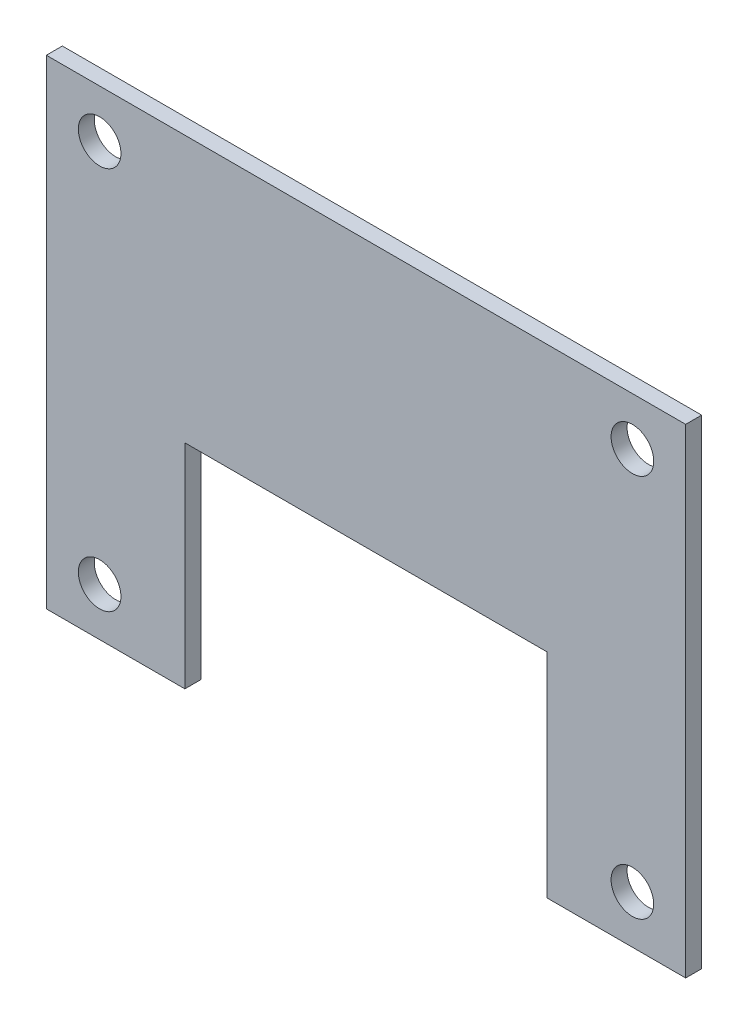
ISO-10303-21;
HEADER;
FILE_DESCRIPTION(('STEP AP214'),'2;1');
FILE_NAME('part.step','',(''),(''),'','','');
FILE_SCHEMA(('AUTOMOTIVE_DESIGN { 1 0 10303 214 1 1 1 1 }'));
ENDSEC;
DATA;
#1=APPLICATION_CONTEXT('core data for automotive mechanical design processes');
#2=APPLICATION_PROTOCOL_DEFINITION('international standard','automotive_design',2000,#1);
#3=PRODUCT_CONTEXT('',#1,'mechanical');
#4=PRODUCT('Part','Part','',(#3));
#5=PRODUCT_RELATED_PRODUCT_CATEGORY('part','',(#4));
#6=PRODUCT_DEFINITION_FORMATION('','',#4);
#7=PRODUCT_DEFINITION_CONTEXT('part definition',#1,'design');
#8=PRODUCT_DEFINITION('design','',#6,#7);
#9=PRODUCT_DEFINITION_SHAPE('','',#8);
#10=(LENGTH_UNIT() NAMED_UNIT(*) SI_UNIT(.MILLI.,.METRE.));
#11=(NAMED_UNIT(*) PLANE_ANGLE_UNIT() SI_UNIT($,.RADIAN.));
#12=(NAMED_UNIT(*) SI_UNIT($,.STERADIAN.) SOLID_ANGLE_UNIT());
#13=UNCERTAINTY_MEASURE_WITH_UNIT(LENGTH_MEASURE(1.E-05),#10,'distance_accuracy_value','');
#14=(GEOMETRIC_REPRESENTATION_CONTEXT(3) GLOBAL_UNCERTAINTY_ASSIGNED_CONTEXT((#13)) GLOBAL_UNIT_ASSIGNED_CONTEXT((#10,
#11,#12)) REPRESENTATION_CONTEXT('',''));
#15=CARTESIAN_POINT('',(0.,0.,0.));
#16=DIRECTION('',(0.,0.,1.));
#17=DIRECTION('',(1.,0.,0.));
#18=AXIS2_PLACEMENT_3D('',#15,#16,#17);
#19=CARTESIAN_POINT('',(0.,0.,1.5));
#20=DIRECTION('',(0.,0.,-1.));
#21=DIRECTION('',(-1.,0.,0.));
#22=AXIS2_PLACEMENT_3D('',#19,#20,#21);
#23=PLANE('',#22);
#24=CARTESIAN_POINT('',(55.,4.5,1.5));
#25=DIRECTION('',(0.,0.,1.));
#26=DIRECTION('',(1.,0.,0.));
#27=AXIS2_PLACEMENT_3D('',#24,#25,#26);
#28=CIRCLE('',#27,2.);
#29=CARTESIAN_POINT('',(57.,4.5,1.5));
#30=VERTEX_POINT('',#29);
#31=EDGE_CURVE('E186',#30,#30,#28,.T.);
#32=ORIENTED_EDGE('',*,*,#31,.F.);
#33=EDGE_LOOP('',(#32));
#34=FACE_BOUND('',#33,.T.);
#35=CARTESIAN_POINT('',(5.,40.5,1.5));
#36=DIRECTION('',(0.,0.,1.));
#37=DIRECTION('',(1.,0.,0.));
#38=AXIS2_PLACEMENT_3D('',#35,#36,#37);
#39=CIRCLE('',#38,2.);
#40=CARTESIAN_POINT('',(7.,40.5,1.5));
#41=VERTEX_POINT('',#40);
#42=EDGE_CURVE('E132',#41,#41,#39,.T.);
#43=ORIENTED_EDGE('',*,*,#42,.F.);
#44=EDGE_LOOP('',(#43));
#45=FACE_BOUND('',#44,.T.);
#46=DIRECTION('',(1.,0.,0.));
#47=VECTOR('',#46,1.);
#48=CARTESIAN_POINT('',(13.,0.,1.5));
#49=LINE('',#48,#47);
#50=CARTESIAN_POINT('',(0.,0.,1.5));
#51=VERTEX_POINT('',#50);
#52=CARTESIAN_POINT('',(13.,0.,1.5));
#53=VERTEX_POINT('',#52);
#54=EDGE_CURVE('E143',#51,#53,#49,.T.);
#55=ORIENTED_EDGE('',*,*,#54,.T.);
#56=DIRECTION('',(0.,1.,0.));
#57=VECTOR('',#56,1.);
#58=CARTESIAN_POINT('',(13.,20.,1.5));
#59=LINE('',#58,#57);
#60=CARTESIAN_POINT('',(13.,20.,1.5));
#61=VERTEX_POINT('',#60);
#62=EDGE_CURVE('E91',#53,#61,#59,.T.);
#63=ORIENTED_EDGE('',*,*,#62,.T.);
#64=DIRECTION('',(1.,0.,0.));
#65=VECTOR('',#64,1.);
#66=CARTESIAN_POINT('',(47.,20.,1.5));
#67=LINE('',#66,#65);
#68=CARTESIAN_POINT('',(47.,20.,1.5));
#69=VERTEX_POINT('',#68);
#70=EDGE_CURVE('E158',#61,#69,#67,.T.);
#71=ORIENTED_EDGE('',*,*,#70,.T.);
#72=DIRECTION('',(0.,-1.,0.));
#73=VECTOR('',#72,1.);
#74=CARTESIAN_POINT('',(47.,0.,1.5));
#75=LINE('',#74,#73);
#76=CARTESIAN_POINT('',(47.,0.,1.5));
#77=VERTEX_POINT('',#76);
#78=EDGE_CURVE('E171',#69,#77,#75,.T.);
#79=ORIENTED_EDGE('',*,*,#78,.T.);
#80=DIRECTION('',(1.,0.,0.));
#81=VECTOR('',#80,1.);
#82=CARTESIAN_POINT('',(60.,0.,1.5));
#83=LINE('',#82,#81);
#84=CARTESIAN_POINT('',(60.,0.,1.5));
#85=VERTEX_POINT('',#84);
#86=EDGE_CURVE('E110',#77,#85,#83,.T.);
#87=ORIENTED_EDGE('',*,*,#86,.T.);
#88=DIRECTION('',(0.,1.,0.));
#89=VECTOR('',#88,1.);
#90=CARTESIAN_POINT('',(60.,45.,1.5));
#91=LINE('',#90,#89);
#92=CARTESIAN_POINT('',(60.,45.,1.5));
#93=VERTEX_POINT('',#92);
#94=EDGE_CURVE('E104',#85,#93,#91,.T.);
#95=ORIENTED_EDGE('',*,*,#94,.T.);
#96=DIRECTION('',(-1.,0.,0.));
#97=VECTOR('',#96,1.);
#98=CARTESIAN_POINT('',(0.,45.,1.5));
#99=LINE('',#98,#97);
#100=CARTESIAN_POINT('',(0.,45.,1.5));
#101=VERTEX_POINT('',#100);
#102=EDGE_CURVE('E108',#93,#101,#99,.T.);
#103=ORIENTED_EDGE('',*,*,#102,.T.);
#104=DIRECTION('',(0.,-1.,0.));
#105=VECTOR('',#104,1.);
#106=CARTESIAN_POINT('',(0.,0.,1.5));
#107=LINE('',#106,#105);
#108=EDGE_CURVE('E48',#101,#51,#107,.T.);
#109=ORIENTED_EDGE('',*,*,#108,.T.);
#110=EDGE_LOOP('',(#55,#63,#71,#79,#87,#95,#103,#109));
#111=FACE_BOUND('',#110,.T.);
#112=CARTESIAN_POINT('',(55.,40.5,1.5));
#113=DIRECTION('',(0.,0.,1.));
#114=DIRECTION('',(1.,0.,0.));
#115=AXIS2_PLACEMENT_3D('',#112,#113,#114);
#116=CIRCLE('',#115,2.);
#117=CARTESIAN_POINT('',(57.,40.5,1.5));
#118=VERTEX_POINT('',#117);
#119=EDGE_CURVE('E180',#118,#118,#116,.T.);
#120=ORIENTED_EDGE('',*,*,#119,.F.);
#121=EDGE_LOOP('',(#120));
#122=FACE_BOUND('',#121,.T.);
#123=CARTESIAN_POINT('',(5.,4.5,1.5));
#124=DIRECTION('',(0.,0.,1.));
#125=DIRECTION('',(1.,0.,0.));
#126=AXIS2_PLACEMENT_3D('',#123,#124,#125);
#127=CIRCLE('',#126,2.);
#128=CARTESIAN_POINT('',(7.,4.5,1.5));
#129=VERTEX_POINT('',#128);
#130=EDGE_CURVE('E192',#129,#129,#127,.T.);
#131=ORIENTED_EDGE('',*,*,#130,.F.);
#132=EDGE_LOOP('',(#131));
#133=FACE_BOUND('',#132,.T.);
#134=ADVANCED_FACE('F31',(#34,#45,#111,#122,#133),#23,.F.);
#135=CARTESIAN_POINT('',(0.,0.,0.));
#136=DIRECTION('',(0.,0.,-1.));
#137=DIRECTION('',(-1.,0.,0.));
#138=AXIS2_PLACEMENT_3D('',#135,#136,#137);
#139=PLANE('',#138);
#140=CARTESIAN_POINT('',(55.,4.5,0.));
#141=DIRECTION('',(0.,0.,1.));
#142=DIRECTION('',(1.,0.,0.));
#143=AXIS2_PLACEMENT_3D('',#140,#141,#142);
#144=CIRCLE('',#143,2.);
#145=CARTESIAN_POINT('',(57.,4.5,0.));
#146=VERTEX_POINT('',#145);
#147=EDGE_CURVE('E189',#146,#146,#144,.T.);
#148=ORIENTED_EDGE('',*,*,#147,.T.);
#149=EDGE_LOOP('',(#148));
#150=FACE_BOUND('',#149,.T.);
#151=CARTESIAN_POINT('',(5.,40.5,0.));
#152=DIRECTION('',(0.,0.,1.));
#153=DIRECTION('',(1.,0.,0.));
#154=AXIS2_PLACEMENT_3D('',#151,#152,#153);
#155=CIRCLE('',#154,2.);
#156=CARTESIAN_POINT('',(7.,40.5,0.));
#157=VERTEX_POINT('',#156);
#158=EDGE_CURVE('E177',#157,#157,#155,.T.);
#159=ORIENTED_EDGE('',*,*,#158,.T.);
#160=EDGE_LOOP('',(#159));
#161=FACE_BOUND('',#160,.T.);
#162=DIRECTION('',(1.,0.,0.));
#163=VECTOR('',#162,1.);
#164=CARTESIAN_POINT('',(13.,0.,0.));
#165=LINE('',#164,#163);
#166=CARTESIAN_POINT('',(0.,0.,0.));
#167=VERTEX_POINT('',#166);
#168=CARTESIAN_POINT('',(13.,0.,0.));
#169=VERTEX_POINT('',#168);
#170=EDGE_CURVE('E128',#167,#169,#165,.T.);
#171=ORIENTED_EDGE('',*,*,#170,.F.);
#172=DIRECTION('',(0.,-1.,0.));
#173=VECTOR('',#172,1.);
#174=CARTESIAN_POINT('',(0.,0.,0.));
#175=LINE('',#174,#173);
#176=CARTESIAN_POINT('',(0.,45.,0.));
#177=VERTEX_POINT('',#176);
#178=EDGE_CURVE('E83',#177,#167,#175,.T.);
#179=ORIENTED_EDGE('',*,*,#178,.F.);
#180=DIRECTION('',(-1.,0.,0.));
#181=VECTOR('',#180,1.);
#182=CARTESIAN_POINT('',(0.,45.,0.));
#183=LINE('',#182,#181);
#184=CARTESIAN_POINT('',(60.,45.,0.));
#185=VERTEX_POINT('',#184);
#186=EDGE_CURVE('E77',#185,#177,#183,.T.);
#187=ORIENTED_EDGE('',*,*,#186,.F.);
#188=DIRECTION('',(0.,1.,0.));
#189=VECTOR('',#188,1.);
#190=CARTESIAN_POINT('',(60.,45.,0.));
#191=LINE('',#190,#189);
#192=CARTESIAN_POINT('',(60.,0.,0.));
#193=VERTEX_POINT('',#192);
#194=EDGE_CURVE('E118',#193,#185,#191,.T.);
#195=ORIENTED_EDGE('',*,*,#194,.F.);
#196=DIRECTION('',(1.,0.,0.));
#197=VECTOR('',#196,1.);
#198=CARTESIAN_POINT('',(60.,0.,0.));
#199=LINE('',#198,#197);
#200=CARTESIAN_POINT('',(47.,0.,0.));
#201=VERTEX_POINT('',#200);
#202=EDGE_CURVE('E138',#201,#193,#199,.T.);
#203=ORIENTED_EDGE('',*,*,#202,.F.);
#204=DIRECTION('',(0.,-1.,0.));
#205=VECTOR('',#204,1.);
#206=CARTESIAN_POINT('',(47.,0.,0.));
#207=LINE('',#206,#205);
#208=CARTESIAN_POINT('',(47.,20.,0.));
#209=VERTEX_POINT('',#208);
#210=EDGE_CURVE('E136',#209,#201,#207,.T.);
#211=ORIENTED_EDGE('',*,*,#210,.F.);
#212=DIRECTION('',(1.,0.,0.));
#213=VECTOR('',#212,1.);
#214=CARTESIAN_POINT('',(47.,20.,0.));
#215=LINE('',#214,#213);
#216=CARTESIAN_POINT('',(13.,20.,0.));
#217=VERTEX_POINT('',#216);
#218=EDGE_CURVE('E134',#217,#209,#215,.T.);
#219=ORIENTED_EDGE('',*,*,#218,.F.);
#220=DIRECTION('',(0.,1.,0.));
#221=VECTOR('',#220,1.);
#222=CARTESIAN_POINT('',(13.,20.,0.));
#223=LINE('',#222,#221);
#224=EDGE_CURVE('E131',#169,#217,#223,.T.);
#225=ORIENTED_EDGE('',*,*,#224,.F.);
#226=EDGE_LOOP('',(#171,#179,#187,#195,#203,#211,#219,#225));
#227=FACE_BOUND('',#226,.T.);
#228=CARTESIAN_POINT('',(55.,40.5,0.));
#229=DIRECTION('',(0.,0.,1.));
#230=DIRECTION('',(1.,0.,0.));
#231=AXIS2_PLACEMENT_3D('',#228,#229,#230);
#232=CIRCLE('',#231,2.);
#233=CARTESIAN_POINT('',(57.,40.5,0.));
#234=VERTEX_POINT('',#233);
#235=EDGE_CURVE('E183',#234,#234,#232,.T.);
#236=ORIENTED_EDGE('',*,*,#235,.T.);
#237=EDGE_LOOP('',(#236));
#238=FACE_BOUND('',#237,.T.);
#239=CARTESIAN_POINT('',(5.,4.5,0.));
#240=DIRECTION('',(0.,0.,1.));
#241=DIRECTION('',(1.,0.,0.));
#242=AXIS2_PLACEMENT_3D('',#239,#240,#241);
#243=CIRCLE('',#242,2.);
#244=CARTESIAN_POINT('',(7.,4.5,0.));
#245=VERTEX_POINT('',#244);
#246=EDGE_CURVE('E195',#245,#245,#243,.T.);
#247=ORIENTED_EDGE('',*,*,#246,.T.);
#248=EDGE_LOOP('',(#247));
#249=FACE_BOUND('',#248,.T.);
#250=ADVANCED_FACE('F162',(#150,#161,#227,#238,#249),#139,.T.);
#251=CARTESIAN_POINT('',(13.,0.,1.5));
#252=DIRECTION('',(0.,1.,0.));
#253=DIRECTION('',(-1.,0.,0.));
#254=AXIS2_PLACEMENT_3D('',#251,#252,#253);
#255=PLANE('',#254);
#256=ORIENTED_EDGE('',*,*,#170,.T.);
#257=DIRECTION('',(0.,0.,-1.));
#258=VECTOR('',#257,1.);
#259=CARTESIAN_POINT('',(13.,0.,1.5));
#260=LINE('',#259,#258);
#261=EDGE_CURVE('E11',#53,#169,#260,.T.);
#262=ORIENTED_EDGE('',*,*,#261,.F.);
#263=ORIENTED_EDGE('',*,*,#54,.F.);
#264=DIRECTION('',(0.,0.,-1.));
#265=VECTOR('',#264,1.);
#266=CARTESIAN_POINT('',(0.,0.,1.5));
#267=LINE('',#266,#265);
#268=EDGE_CURVE('E124',#51,#167,#267,.T.);
#269=ORIENTED_EDGE('',*,*,#268,.T.);
#270=EDGE_LOOP('',(#256,#262,#263,#269));
#271=FACE_BOUND('',#270,.T.);
#272=ADVANCED_FACE('F33',(#271),#255,.F.);
#273=CARTESIAN_POINT('',(13.,20.,1.5));
#274=DIRECTION('',(-1.,0.,0.));
#275=DIRECTION('',(0.,-1.,0.));
#276=AXIS2_PLACEMENT_3D('',#273,#274,#275);
#277=PLANE('',#276);
#278=ORIENTED_EDGE('',*,*,#224,.T.);
#279=DIRECTION('',(0.,0.,-1.));
#280=VECTOR('',#279,1.);
#281=CARTESIAN_POINT('',(13.,20.,1.5));
#282=LINE('',#281,#280);
#283=EDGE_CURVE('E40',#61,#217,#282,.T.);
#284=ORIENTED_EDGE('',*,*,#283,.F.);
#285=ORIENTED_EDGE('',*,*,#62,.F.);
#286=ORIENTED_EDGE('',*,*,#261,.T.);
#287=EDGE_LOOP('',(#278,#284,#285,#286));
#288=FACE_BOUND('',#287,.T.);
#289=ADVANCED_FACE('F230',(#288),#277,.F.);
#290=CARTESIAN_POINT('',(47.,20.,1.5));
#291=DIRECTION('',(0.,1.,0.));
#292=DIRECTION('',(-1.,0.,0.));
#293=AXIS2_PLACEMENT_3D('',#290,#291,#292);
#294=PLANE('',#293);
#295=ORIENTED_EDGE('',*,*,#218,.T.);
#296=DIRECTION('',(0.,0.,-1.));
#297=VECTOR('',#296,1.);
#298=CARTESIAN_POINT('',(47.,20.,1.5));
#299=LINE('',#298,#297);
#300=EDGE_CURVE('E150',#69,#209,#299,.T.);
#301=ORIENTED_EDGE('',*,*,#300,.F.);
#302=ORIENTED_EDGE('',*,*,#70,.F.);
#303=ORIENTED_EDGE('',*,*,#283,.T.);
#304=EDGE_LOOP('',(#295,#301,#302,#303));
#305=FACE_BOUND('',#304,.T.);
#306=ADVANCED_FACE('F156',(#305),#294,.F.);
#307=CARTESIAN_POINT('',(47.,0.,1.5));
#308=DIRECTION('',(1.,0.,0.));
#309=DIRECTION('',(0.,1.,0.));
#310=AXIS2_PLACEMENT_3D('',#307,#308,#309);
#311=PLANE('',#310);
#312=ORIENTED_EDGE('',*,*,#210,.T.);
#313=DIRECTION('',(0.,0.,-1.));
#314=VECTOR('',#313,1.);
#315=CARTESIAN_POINT('',(47.,0.,1.5));
#316=LINE('',#315,#314);
#317=EDGE_CURVE('E147',#77,#201,#316,.T.);
#318=ORIENTED_EDGE('',*,*,#317,.F.);
#319=ORIENTED_EDGE('',*,*,#78,.F.);
#320=ORIENTED_EDGE('',*,*,#300,.T.);
#321=EDGE_LOOP('',(#312,#318,#319,#320));
#322=FACE_BOUND('',#321,.T.);
#323=ADVANCED_FACE('F167',(#322),#311,.F.);
#324=CARTESIAN_POINT('',(60.,0.,1.5));
#325=DIRECTION('',(0.,1.,0.));
#326=DIRECTION('',(-1.,0.,0.));
#327=AXIS2_PLACEMENT_3D('',#324,#325,#326);
#328=PLANE('',#327);
#329=ORIENTED_EDGE('',*,*,#202,.T.);
#330=DIRECTION('',(0.,0.,-1.));
#331=VECTOR('',#330,1.);
#332=CARTESIAN_POINT('',(60.,0.,1.5));
#333=LINE('',#332,#331);
#334=EDGE_CURVE('E119',#85,#193,#333,.T.);
#335=ORIENTED_EDGE('',*,*,#334,.F.);
#336=ORIENTED_EDGE('',*,*,#86,.F.);
#337=ORIENTED_EDGE('',*,*,#317,.T.);
#338=EDGE_LOOP('',(#329,#335,#336,#337));
#339=FACE_BOUND('',#338,.T.);
#340=ADVANCED_FACE('F170',(#339),#328,.F.);
#341=CARTESIAN_POINT('',(60.,45.,1.5));
#342=DIRECTION('',(-1.,0.,0.));
#343=DIRECTION('',(0.,-1.,0.));
#344=AXIS2_PLACEMENT_3D('',#341,#342,#343);
#345=PLANE('',#344);
#346=ORIENTED_EDGE('',*,*,#194,.T.);
#347=DIRECTION('',(0.,0.,-1.));
#348=VECTOR('',#347,1.);
#349=CARTESIAN_POINT('',(60.,45.,1.5));
#350=LINE('',#349,#348);
#351=EDGE_CURVE('E115',#93,#185,#350,.T.);
#352=ORIENTED_EDGE('',*,*,#351,.F.);
#353=ORIENTED_EDGE('',*,*,#94,.F.);
#354=ORIENTED_EDGE('',*,*,#334,.T.);
#355=EDGE_LOOP('',(#346,#352,#353,#354));
#356=FACE_BOUND('',#355,.T.);
#357=ADVANCED_FACE('F116',(#356),#345,.F.);
#358=CARTESIAN_POINT('',(0.,45.,1.5));
#359=DIRECTION('',(0.,-1.,0.));
#360=DIRECTION('',(0.,0.,-1.));
#361=AXIS2_PLACEMENT_3D('',#358,#359,#360);
#362=PLANE('',#361);
#363=ORIENTED_EDGE('',*,*,#186,.T.);
#364=DIRECTION('',(0.,0.,-1.));
#365=VECTOR('',#364,1.);
#366=CARTESIAN_POINT('',(0.,45.,1.5));
#367=LINE('',#366,#365);
#368=EDGE_CURVE('E120',#101,#177,#367,.T.);
#369=ORIENTED_EDGE('',*,*,#368,.F.);
#370=ORIENTED_EDGE('',*,*,#102,.F.);
#371=ORIENTED_EDGE('',*,*,#351,.T.);
#372=EDGE_LOOP('',(#363,#369,#370,#371));
#373=FACE_BOUND('',#372,.T.);
#374=ADVANCED_FACE('F122',(#373),#362,.F.);
#375=CARTESIAN_POINT('',(0.,0.,1.5));
#376=DIRECTION('',(1.,0.,0.));
#377=DIRECTION('',(0.,0.,-1.));
#378=AXIS2_PLACEMENT_3D('',#375,#376,#377);
#379=PLANE('',#378);
#380=ORIENTED_EDGE('',*,*,#178,.T.);
#381=ORIENTED_EDGE('',*,*,#268,.F.);
#382=ORIENTED_EDGE('',*,*,#108,.F.);
#383=ORIENTED_EDGE('',*,*,#368,.T.);
#384=EDGE_LOOP('',(#380,#381,#382,#383));
#385=FACE_BOUND('',#384,.T.);
#386=ADVANCED_FACE('F218',(#385),#379,.F.);
#387=CARTESIAN_POINT('',(5.,40.5,1.5));
#388=DIRECTION('',(0.,0.,-1.));
#389=DIRECTION('',(-1.,0.,0.));
#390=AXIS2_PLACEMENT_3D('',#387,#388,#389);
#391=CYLINDRICAL_SURFACE('',#390,2.);
#392=ORIENTED_EDGE('',*,*,#42,.T.);
#393=EDGE_LOOP('',(#392));
#394=FACE_BOUND('',#393,.T.);
#395=ORIENTED_EDGE('',*,*,#158,.F.);
#396=EDGE_LOOP('',(#395));
#397=FACE_BOUND('',#396,.T.);
#398=ADVANCED_FACE('F215',(#394,#397),#391,.F.);
#399=CARTESIAN_POINT('',(55.,40.5,1.5));
#400=DIRECTION('',(0.,0.,-1.));
#401=DIRECTION('',(-1.,0.,0.));
#402=AXIS2_PLACEMENT_3D('',#399,#400,#401);
#403=CYLINDRICAL_SURFACE('',#402,2.);
#404=ORIENTED_EDGE('',*,*,#119,.T.);
#405=EDGE_LOOP('',(#404));
#406=FACE_BOUND('',#405,.T.);
#407=ORIENTED_EDGE('',*,*,#235,.F.);
#408=EDGE_LOOP('',(#407));
#409=FACE_BOUND('',#408,.T.);
#410=ADVANCED_FACE('F294',(#406,#409),#403,.F.);
#411=CARTESIAN_POINT('',(55.,4.5,1.5));
#412=DIRECTION('',(0.,0.,-1.));
#413=DIRECTION('',(-1.,0.,0.));
#414=AXIS2_PLACEMENT_3D('',#411,#412,#413);
#415=CYLINDRICAL_SURFACE('',#414,2.);
#416=ORIENTED_EDGE('',*,*,#31,.T.);
#417=EDGE_LOOP('',(#416));
#418=FACE_BOUND('',#417,.T.);
#419=ORIENTED_EDGE('',*,*,#147,.F.);
#420=EDGE_LOOP('',(#419));
#421=FACE_BOUND('',#420,.T.);
#422=ADVANCED_FACE('F302',(#418,#421),#415,.F.);
#423=CARTESIAN_POINT('',(5.,4.5,1.5));
#424=DIRECTION('',(0.,0.,-1.));
#425=DIRECTION('',(-1.,0.,0.));
#426=AXIS2_PLACEMENT_3D('',#423,#424,#425);
#427=CYLINDRICAL_SURFACE('',#426,2.);
#428=ORIENTED_EDGE('',*,*,#130,.T.);
#429=EDGE_LOOP('',(#428));
#430=FACE_BOUND('',#429,.T.);
#431=ORIENTED_EDGE('',*,*,#246,.F.);
#432=EDGE_LOOP('',(#431));
#433=FACE_BOUND('',#432,.T.);
#434=ADVANCED_FACE('F201',(#430,#433),#427,.F.);
#435=CLOSED_SHELL('',(#134,#250,#272,#289,#306,#323,#340,#357,#374,#386,#398,#410,#422,#434));
#436=MANIFOLD_SOLID_BREP('B2',#435);
#437=ADVANCED_BREP_SHAPE_REPRESENTATION('',(#18,#436),#14);
#438=SHAPE_DEFINITION_REPRESENTATION(#9,#437);
ENDSEC;
END-ISO-10303-21;
